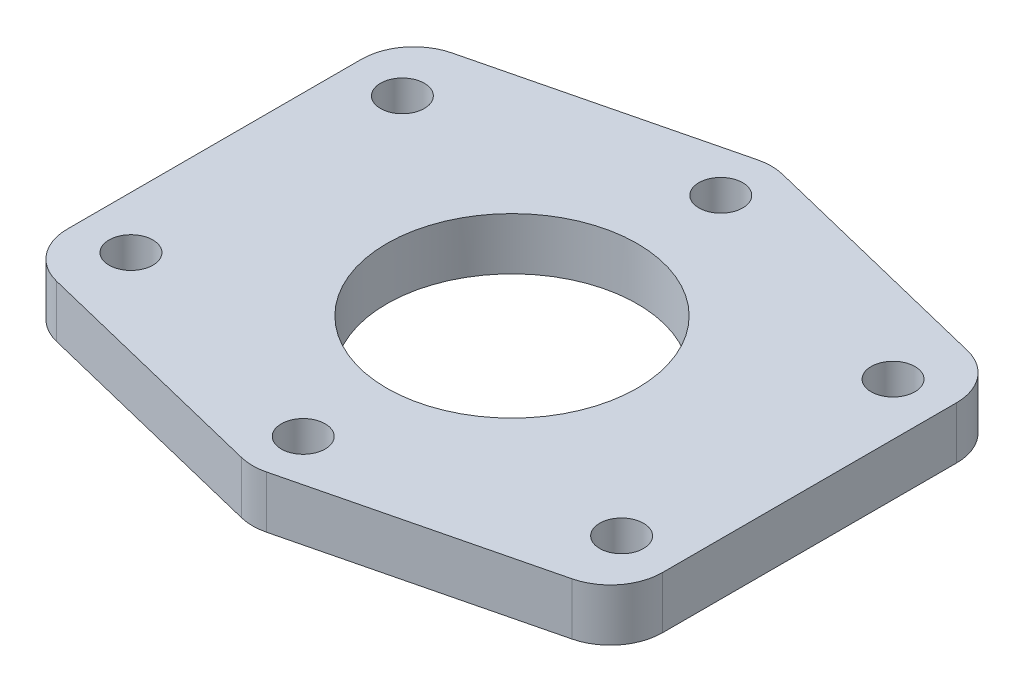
ISO-10303-21;
HEADER;
FILE_DESCRIPTION(('STEP AP214'),'2;1');
FILE_NAME('part.step','',(''),(''),'','','');
FILE_SCHEMA(('AUTOMOTIVE_DESIGN { 1 0 10303 214 1 1 1 1 }'));
ENDSEC;
DATA;
#1=APPLICATION_CONTEXT('core data for automotive mechanical design processes');
#2=APPLICATION_PROTOCOL_DEFINITION('international standard','automotive_design',2000,#1);
#3=PRODUCT_CONTEXT('',#1,'mechanical');
#4=PRODUCT('Part','Part','',(#3));
#5=PRODUCT_RELATED_PRODUCT_CATEGORY('part','',(#4));
#6=PRODUCT_DEFINITION_FORMATION('','',#4);
#7=PRODUCT_DEFINITION_CONTEXT('part definition',#1,'design');
#8=PRODUCT_DEFINITION('design','',#6,#7);
#9=PRODUCT_DEFINITION_SHAPE('','',#8);
#10=(LENGTH_UNIT() NAMED_UNIT(*) SI_UNIT(.MILLI.,.METRE.));
#11=(NAMED_UNIT(*) PLANE_ANGLE_UNIT() SI_UNIT($,.RADIAN.));
#12=(NAMED_UNIT(*) SI_UNIT($,.STERADIAN.) SOLID_ANGLE_UNIT());
#13=UNCERTAINTY_MEASURE_WITH_UNIT(LENGTH_MEASURE(1.E-05),#10,'distance_accuracy_value','');
#14=(GEOMETRIC_REPRESENTATION_CONTEXT(3) GLOBAL_UNCERTAINTY_ASSIGNED_CONTEXT((#13)) GLOBAL_UNIT_ASSIGNED_CONTEXT((#10,
#11,#12)) REPRESENTATION_CONTEXT('',''));
#15=CARTESIAN_POINT('',(0.,0.,0.));
#16=DIRECTION('',(0.,0.,1.));
#17=DIRECTION('',(1.,0.,0.));
#18=AXIS2_PLACEMENT_3D('',#15,#16,#17);
#19=CARTESIAN_POINT('',(0.,5.,0.));
#20=DIRECTION('',(0.,-1.,0.));
#21=DIRECTION('',(0.,0.,-1.));
#22=AXIS2_PLACEMENT_3D('',#19,#20,#21);
#23=PLANE('',#22);
#24=CARTESIAN_POINT('',(0.,5.,-20.));
#25=DIRECTION('',(0.,1.,0.));
#26=DIRECTION('',(0.,0.,1.));
#27=AXIS2_PLACEMENT_3D('',#24,#25,#26);
#28=CIRCLE('',#27,2.1);
#29=CARTESIAN_POINT('',(0.,5.,-17.9));
#30=VERTEX_POINT('',#29);
#31=EDGE_CURVE('E170',#30,#30,#28,.T.);
#32=ORIENTED_EDGE('',*,*,#31,.F.);
#33=EDGE_LOOP('',(#32));
#34=FACE_BOUND('',#33,.T.);
#35=CARTESIAN_POINT('',(0.,5.,20.));
#36=DIRECTION('',(0.,1.,0.));
#37=DIRECTION('',(0.,0.,1.));
#38=AXIS2_PLACEMENT_3D('',#35,#36,#37);
#39=CIRCLE('',#38,2.1);
#40=CARTESIAN_POINT('',(0.,5.,22.1));
#41=VERTEX_POINT('',#40);
#42=EDGE_CURVE('E283',#41,#41,#39,.T.);
#43=ORIENTED_EDGE('',*,*,#42,.F.);
#44=EDGE_LOOP('',(#43));
#45=FACE_BOUND('',#44,.T.);
#46=CARTESIAN_POINT('',(0.,5.,0.));
#47=DIRECTION('',(0.,-1.,0.));
#48=DIRECTION('',(0.,0.,-1.));
#49=AXIS2_PLACEMENT_3D('',#46,#47,#48);
#50=CIRCLE('',#49,12.);
#51=CARTESIAN_POINT('',(0.,5.,-12.));
#52=VERTEX_POINT('',#51);
#53=EDGE_CURVE('E241',#52,#52,#50,.T.);
#54=ORIENTED_EDGE('',*,*,#53,.T.);
#55=EDGE_LOOP('',(#54));
#56=FACE_BOUND('',#55,.T.);
#57=DIRECTION('',(-0.971136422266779,0.,0.238524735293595));
#58=VECTOR('',#57,1.);
#59=CARTESIAN_POINT('',(-28.5,5.,-18.));
#60=LINE('',#59,#58);
#61=CARTESIAN_POINT('',(-1.19262367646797,5.,-24.7070748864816));
#62=VERTEX_POINT('',#61);
#63=CARTESIAN_POINT('',(-24.692623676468,5.,-18.9351450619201));
#64=VERTEX_POINT('',#63);
#65=EDGE_CURVE('E226',#62,#64,#60,.T.);
#66=ORIENTED_EDGE('',*,*,#65,.T.);
#67=CARTESIAN_POINT('',(-23.5,5.,-14.0794629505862));
#68=DIRECTION('',(0.,-1.,0.));
#69=DIRECTION('',(0.,0.,-1.));
#70=AXIS2_PLACEMENT_3D('',#67,#68,#69);
#71=CIRCLE('',#70,5.);
#72=CARTESIAN_POINT('',(-28.5,5.,-14.0794629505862));
#73=VERTEX_POINT('',#72);
#74=EDGE_CURVE('E195',#64,#73,#71,.F.);
#75=ORIENTED_EDGE('',*,*,#74,.T.);
#76=DIRECTION('',(0.,0.,1.));
#77=VECTOR('',#76,1.);
#78=CARTESIAN_POINT('',(-28.5,5.,18.));
#79=LINE('',#78,#77);
#80=CARTESIAN_POINT('',(-28.5,5.,14.0794629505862));
#81=VERTEX_POINT('',#80);
#82=EDGE_CURVE('E149',#73,#81,#79,.T.);
#83=ORIENTED_EDGE('',*,*,#82,.T.);
#84=CARTESIAN_POINT('',(-23.5,5.,14.0794629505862));
#85=DIRECTION('',(0.,-1.,0.));
#86=DIRECTION('',(0.,0.,-1.));
#87=AXIS2_PLACEMENT_3D('',#84,#85,#86);
#88=CIRCLE('',#87,5.);
#89=CARTESIAN_POINT('',(-24.692623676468,5.,18.9351450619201));
#90=VERTEX_POINT('',#89);
#91=EDGE_CURVE('E193',#81,#90,#88,.F.);
#92=ORIENTED_EDGE('',*,*,#91,.T.);
#93=DIRECTION('',(0.971136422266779,0.,0.238524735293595));
#94=VECTOR('',#93,1.);
#95=CARTESIAN_POINT('',(-28.5,5.,18.));
#96=LINE('',#95,#94);
#97=CARTESIAN_POINT('',(-1.19262367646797,5.,24.7070748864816));
#98=VERTEX_POINT('',#97);
#99=EDGE_CURVE('E275',#90,#98,#96,.T.);
#100=ORIENTED_EDGE('',*,*,#99,.T.);
#101=CARTESIAN_POINT('',(0.,5.,19.8513927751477));
#102=DIRECTION('',(0.,-1.,0.));
#103=DIRECTION('',(0.,0.,-1.));
#104=AXIS2_PLACEMENT_3D('',#101,#102,#103);
#105=CIRCLE('',#104,5.);
#106=CARTESIAN_POINT('',(1.19262367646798,5.,24.7070748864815));
#107=VERTEX_POINT('',#106);
#108=EDGE_CURVE('E60',#98,#107,#105,.F.);
#109=ORIENTED_EDGE('',*,*,#108,.T.);
#110=DIRECTION('',(0.971136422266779,0.,-0.238524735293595));
#111=VECTOR('',#110,1.);
#112=CARTESIAN_POINT('',(0.,5.,25.));
#113=LINE('',#112,#111);
#114=CARTESIAN_POINT('',(24.692623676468,5.,18.9351450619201));
#115=VERTEX_POINT('',#114);
#116=EDGE_CURVE('E234',#107,#115,#113,.T.);
#117=ORIENTED_EDGE('',*,*,#116,.T.);
#118=CARTESIAN_POINT('',(23.5,5.,14.0794629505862));
#119=DIRECTION('',(0.,-1.,0.));
#120=DIRECTION('',(0.,0.,-1.));
#121=AXIS2_PLACEMENT_3D('',#118,#119,#120);
#122=CIRCLE('',#121,5.);
#123=CARTESIAN_POINT('',(28.5,5.,14.0794629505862));
#124=VERTEX_POINT('',#123);
#125=EDGE_CURVE('E191',#115,#124,#122,.F.);
#126=ORIENTED_EDGE('',*,*,#125,.T.);
#127=DIRECTION('',(0.,0.,-1.));
#128=VECTOR('',#127,1.);
#129=CARTESIAN_POINT('',(28.5,5.,18.));
#130=LINE('',#129,#128);
#131=CARTESIAN_POINT('',(28.5,5.,-14.0794629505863));
#132=VERTEX_POINT('',#131);
#133=EDGE_CURVE('E156',#124,#132,#130,.T.);
#134=ORIENTED_EDGE('',*,*,#133,.T.);
#135=CARTESIAN_POINT('',(23.5,5.,-14.0794629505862));
#136=DIRECTION('',(0.,-1.,0.));
#137=DIRECTION('',(0.,0.,-1.));
#138=AXIS2_PLACEMENT_3D('',#135,#136,#137);
#139=CIRCLE('',#138,5.);
#140=CARTESIAN_POINT('',(24.692623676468,5.,-18.9351450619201));
#141=VERTEX_POINT('',#140);
#142=EDGE_CURVE('E189',#132,#141,#139,.F.);
#143=ORIENTED_EDGE('',*,*,#142,.T.);
#144=DIRECTION('',(-0.971136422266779,0.,-0.238524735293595));
#145=VECTOR('',#144,1.);
#146=CARTESIAN_POINT('',(0.,5.,-25.));
#147=LINE('',#146,#145);
#148=CARTESIAN_POINT('',(1.19262367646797,5.,-24.7070748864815));
#149=VERTEX_POINT('',#148);
#150=EDGE_CURVE('E216',#141,#149,#147,.T.);
#151=ORIENTED_EDGE('',*,*,#150,.T.);
#152=CARTESIAN_POINT('',(0.,5.,-19.8513927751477));
#153=DIRECTION('',(0.,-1.,0.));
#154=DIRECTION('',(0.,0.,-1.));
#155=AXIS2_PLACEMENT_3D('',#152,#153,#154);
#156=CIRCLE('',#155,5.);
#157=EDGE_CURVE('E187',#149,#62,#156,.F.);
#158=ORIENTED_EDGE('',*,*,#157,.T.);
#159=EDGE_LOOP('',(#66,#75,#83,#92,#100,#109,#117,#126,#134,#143,#151,#158));
#160=FACE_BOUND('',#159,.T.);
#161=CARTESIAN_POINT('',(-23.5,5.,-13.));
#162=DIRECTION('',(0.,1.,0.));
#163=DIRECTION('',(0.,0.,1.));
#164=AXIS2_PLACEMENT_3D('',#161,#162,#163);
#165=CIRCLE('',#164,2.1);
#166=CARTESIAN_POINT('',(-23.5,5.,-10.9));
#167=VERTEX_POINT('',#166);
#168=EDGE_CURVE('E162',#167,#167,#165,.T.);
#169=ORIENTED_EDGE('',*,*,#168,.F.);
#170=EDGE_LOOP('',(#169));
#171=FACE_BOUND('',#170,.T.);
#172=CARTESIAN_POINT('',(-23.5,5.,13.));
#173=DIRECTION('',(0.,1.,0.));
#174=DIRECTION('',(0.,0.,1.));
#175=AXIS2_PLACEMENT_3D('',#172,#173,#174);
#176=CIRCLE('',#175,2.1);
#177=CARTESIAN_POINT('',(-23.5,5.,15.1));
#178=VERTEX_POINT('',#177);
#179=EDGE_CURVE('E257',#178,#178,#176,.T.);
#180=ORIENTED_EDGE('',*,*,#179,.F.);
#181=EDGE_LOOP('',(#180));
#182=FACE_BOUND('',#181,.T.);
#183=CARTESIAN_POINT('',(23.5,5.,-13.));
#184=DIRECTION('',(0.,1.,0.));
#185=DIRECTION('',(0.,0.,1.));
#186=AXIS2_PLACEMENT_3D('',#183,#184,#185);
#187=CIRCLE('',#186,2.1);
#188=CARTESIAN_POINT('',(23.5,5.,-10.9));
#189=VERTEX_POINT('',#188);
#190=EDGE_CURVE('E251',#189,#189,#187,.T.);
#191=ORIENTED_EDGE('',*,*,#190,.F.);
#192=EDGE_LOOP('',(#191));
#193=FACE_BOUND('',#192,.T.);
#194=CARTESIAN_POINT('',(23.5,5.,13.));
#195=DIRECTION('',(0.,1.,0.));
#196=DIRECTION('',(0.,0.,1.));
#197=AXIS2_PLACEMENT_3D('',#194,#195,#196);
#198=CIRCLE('',#197,2.1);
#199=CARTESIAN_POINT('',(23.5,5.,15.1));
#200=VERTEX_POINT('',#199);
#201=EDGE_CURVE('E245',#200,#200,#198,.T.);
#202=ORIENTED_EDGE('',*,*,#201,.F.);
#203=EDGE_LOOP('',(#202));
#204=FACE_BOUND('',#203,.T.);
#205=ADVANCED_FACE('F38',(#34,#45,#56,#160,#171,#182,#193,#204),#23,.F.);
#206=CARTESIAN_POINT('',(0.,0.,0.));
#207=DIRECTION('',(0.,-1.,0.));
#208=DIRECTION('',(0.,0.,-1.));
#209=AXIS2_PLACEMENT_3D('',#206,#207,#208);
#210=PLANE('',#209);
#211=CARTESIAN_POINT('',(0.,0.,-20.));
#212=DIRECTION('',(0.,-1.,0.));
#213=DIRECTION('',(0.,0.,-1.));
#214=AXIS2_PLACEMENT_3D('',#211,#212,#213);
#215=CIRCLE('',#214,2.1);
#216=CARTESIAN_POINT('',(0.,0.,-22.1));
#217=VERTEX_POINT('',#216);
#218=EDGE_CURVE('E169',#217,#217,#215,.F.);
#219=ORIENTED_EDGE('',*,*,#218,.T.);
#220=EDGE_LOOP('',(#219));
#221=FACE_BOUND('',#220,.T.);
#222=CARTESIAN_POINT('',(0.,0.,20.));
#223=DIRECTION('',(0.,-1.,0.));
#224=DIRECTION('',(0.,0.,-1.));
#225=AXIS2_PLACEMENT_3D('',#222,#223,#224);
#226=CIRCLE('',#225,2.1);
#227=CARTESIAN_POINT('',(0.,0.,17.9));
#228=VERTEX_POINT('',#227);
#229=EDGE_CURVE('E166',#228,#228,#226,.F.);
#230=ORIENTED_EDGE('',*,*,#229,.T.);
#231=EDGE_LOOP('',(#230));
#232=FACE_BOUND('',#231,.T.);
#233=CARTESIAN_POINT('',(0.,0.,0.));
#234=DIRECTION('',(0.,1.,0.));
#235=DIRECTION('',(0.,0.,1.));
#236=AXIS2_PLACEMENT_3D('',#233,#234,#235);
#237=CIRCLE('',#236,12.);
#238=CARTESIAN_POINT('',(0.,0.,12.));
#239=VERTEX_POINT('',#238);
#240=EDGE_CURVE('E238',#239,#239,#237,.T.);
#241=ORIENTED_EDGE('',*,*,#240,.T.);
#242=EDGE_LOOP('',(#241));
#243=FACE_BOUND('',#242,.T.);
#244=CARTESIAN_POINT('',(23.5,0.,-13.));
#245=DIRECTION('',(0.,1.,0.));
#246=DIRECTION('',(0.,0.,1.));
#247=AXIS2_PLACEMENT_3D('',#244,#245,#246);
#248=CIRCLE('',#247,2.1);
#249=CARTESIAN_POINT('',(23.5,0.,-10.9));
#250=VERTEX_POINT('',#249);
#251=EDGE_CURVE('E248',#250,#250,#248,.T.);
#252=ORIENTED_EDGE('',*,*,#251,.T.);
#253=EDGE_LOOP('',(#252));
#254=FACE_BOUND('',#253,.T.);
#255=CARTESIAN_POINT('',(-23.5,0.,-13.));
#256=DIRECTION('',(0.,1.,0.));
#257=DIRECTION('',(0.,0.,1.));
#258=AXIS2_PLACEMENT_3D('',#255,#256,#257);
#259=CIRCLE('',#258,2.1);
#260=CARTESIAN_POINT('',(-23.5,0.,-10.9));
#261=VERTEX_POINT('',#260);
#262=EDGE_CURVE('E260',#261,#261,#259,.T.);
#263=ORIENTED_EDGE('',*,*,#262,.T.);
#264=EDGE_LOOP('',(#263));
#265=FACE_BOUND('',#264,.T.);
#266=DIRECTION('',(0.,0.,1.));
#267=VECTOR('',#266,1.);
#268=CARTESIAN_POINT('',(-28.5,0.,18.));
#269=LINE('',#268,#267);
#270=CARTESIAN_POINT('',(-28.5,0.,-14.0794629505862));
#271=VERTEX_POINT('',#270);
#272=CARTESIAN_POINT('',(-28.5,0.,14.0794629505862));
#273=VERTEX_POINT('',#272);
#274=EDGE_CURVE('E146',#271,#273,#269,.T.);
#275=ORIENTED_EDGE('',*,*,#274,.F.);
#276=CARTESIAN_POINT('',(-23.5,0.,-14.0794629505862));
#277=DIRECTION('',(0.,-1.,0.));
#278=DIRECTION('',(0.,0.,-1.));
#279=AXIS2_PLACEMENT_3D('',#276,#277,#278);
#280=CIRCLE('',#279,5.);
#281=CARTESIAN_POINT('',(-24.692623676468,0.,-18.9351450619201));
#282=VERTEX_POINT('',#281);
#283=EDGE_CURVE('E129',#271,#282,#280,.T.);
#284=ORIENTED_EDGE('',*,*,#283,.T.);
#285=DIRECTION('',(-0.971136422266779,0.,0.238524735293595));
#286=VECTOR('',#285,1.);
#287=CARTESIAN_POINT('',(-28.5,0.,-18.));
#288=LINE('',#287,#286);
#289=CARTESIAN_POINT('',(-1.19262367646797,0.,-24.7070748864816));
#290=VERTEX_POINT('',#289);
#291=EDGE_CURVE('E227',#290,#282,#288,.T.);
#292=ORIENTED_EDGE('',*,*,#291,.F.);
#293=CARTESIAN_POINT('',(0.,0.,-19.8513927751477));
#294=DIRECTION('',(0.,-1.,0.));
#295=DIRECTION('',(0.,0.,-1.));
#296=AXIS2_PLACEMENT_3D('',#293,#294,#295);
#297=CIRCLE('',#296,5.);
#298=CARTESIAN_POINT('',(1.19262367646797,0.,-24.7070748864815));
#299=VERTEX_POINT('',#298);
#300=EDGE_CURVE('E176',#290,#299,#297,.T.);
#301=ORIENTED_EDGE('',*,*,#300,.T.);
#302=DIRECTION('',(-0.971136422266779,0.,-0.238524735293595));
#303=VECTOR('',#302,1.);
#304=CARTESIAN_POINT('',(0.,0.,-25.));
#305=LINE('',#304,#303);
#306=CARTESIAN_POINT('',(24.692623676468,0.,-18.9351450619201));
#307=VERTEX_POINT('',#306);
#308=EDGE_CURVE('E219',#307,#299,#305,.T.);
#309=ORIENTED_EDGE('',*,*,#308,.F.);
#310=CARTESIAN_POINT('',(23.5,0.,-14.0794629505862));
#311=DIRECTION('',(0.,-1.,0.));
#312=DIRECTION('',(0.,0.,-1.));
#313=AXIS2_PLACEMENT_3D('',#310,#311,#312);
#314=CIRCLE('',#313,5.);
#315=CARTESIAN_POINT('',(28.5,0.,-14.0794629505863));
#316=VERTEX_POINT('',#315);
#317=EDGE_CURVE('E178',#307,#316,#314,.T.);
#318=ORIENTED_EDGE('',*,*,#317,.T.);
#319=DIRECTION('',(0.,0.,-1.));
#320=VECTOR('',#319,1.);
#321=CARTESIAN_POINT('',(28.5,0.,18.));
#322=LINE('',#321,#320);
#323=CARTESIAN_POINT('',(28.5,0.,14.0794629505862));
#324=VERTEX_POINT('',#323);
#325=EDGE_CURVE('E157',#324,#316,#322,.T.);
#326=ORIENTED_EDGE('',*,*,#325,.F.);
#327=CARTESIAN_POINT('',(23.5,0.,14.0794629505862));
#328=DIRECTION('',(0.,-1.,0.));
#329=DIRECTION('',(0.,0.,-1.));
#330=AXIS2_PLACEMENT_3D('',#327,#328,#329);
#331=CIRCLE('',#330,5.);
#332=CARTESIAN_POINT('',(24.692623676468,0.,18.9351450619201));
#333=VERTEX_POINT('',#332);
#334=EDGE_CURVE('E180',#324,#333,#331,.T.);
#335=ORIENTED_EDGE('',*,*,#334,.T.);
#336=DIRECTION('',(0.971136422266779,0.,-0.238524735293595));
#337=VECTOR('',#336,1.);
#338=CARTESIAN_POINT('',(0.,0.,25.));
#339=LINE('',#338,#337);
#340=CARTESIAN_POINT('',(1.19262367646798,0.,24.7070748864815));
#341=VERTEX_POINT('',#340);
#342=EDGE_CURVE('E277',#341,#333,#339,.T.);
#343=ORIENTED_EDGE('',*,*,#342,.F.);
#344=CARTESIAN_POINT('',(0.,0.,19.8513927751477));
#345=DIRECTION('',(0.,-1.,0.));
#346=DIRECTION('',(0.,0.,-1.));
#347=AXIS2_PLACEMENT_3D('',#344,#345,#346);
#348=CIRCLE('',#347,5.);
#349=CARTESIAN_POINT('',(-1.19262367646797,0.,24.7070748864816));
#350=VERTEX_POINT('',#349);
#351=EDGE_CURVE('E150',#341,#350,#348,.T.);
#352=ORIENTED_EDGE('',*,*,#351,.T.);
#353=DIRECTION('',(0.971136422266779,0.,0.238524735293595));
#354=VECTOR('',#353,1.);
#355=CARTESIAN_POINT('',(-28.5,0.,18.));
#356=LINE('',#355,#354);
#357=CARTESIAN_POINT('',(-24.692623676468,0.,18.9351450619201));
#358=VERTEX_POINT('',#357);
#359=EDGE_CURVE('E173',#358,#350,#356,.T.);
#360=ORIENTED_EDGE('',*,*,#359,.F.);
#361=CARTESIAN_POINT('',(-23.5,0.,14.0794629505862));
#362=DIRECTION('',(0.,-1.,0.));
#363=DIRECTION('',(0.,0.,-1.));
#364=AXIS2_PLACEMENT_3D('',#361,#362,#363);
#365=CIRCLE('',#364,5.);
#366=EDGE_CURVE('E140',#358,#273,#365,.T.);
#367=ORIENTED_EDGE('',*,*,#366,.T.);
#368=EDGE_LOOP('',(#275,#284,#292,#301,#309,#318,#326,#335,#343,#352,#360,#367));
#369=FACE_BOUND('',#368,.T.);
#370=CARTESIAN_POINT('',(-23.5,0.,13.));
#371=DIRECTION('',(0.,1.,0.));
#372=DIRECTION('',(0.,0.,1.));
#373=AXIS2_PLACEMENT_3D('',#370,#371,#372);
#374=CIRCLE('',#373,2.1);
#375=CARTESIAN_POINT('',(-23.5,0.,15.1));
#376=VERTEX_POINT('',#375);
#377=EDGE_CURVE('E254',#376,#376,#374,.T.);
#378=ORIENTED_EDGE('',*,*,#377,.T.);
#379=EDGE_LOOP('',(#378));
#380=FACE_BOUND('',#379,.T.);
#381=CARTESIAN_POINT('',(23.5,0.,13.));
#382=DIRECTION('',(0.,1.,0.));
#383=DIRECTION('',(0.,0.,1.));
#384=AXIS2_PLACEMENT_3D('',#381,#382,#383);
#385=CIRCLE('',#384,2.1);
#386=CARTESIAN_POINT('',(23.5,0.,15.1));
#387=VERTEX_POINT('',#386);
#388=EDGE_CURVE('E244',#387,#387,#385,.T.);
#389=ORIENTED_EDGE('',*,*,#388,.T.);
#390=EDGE_LOOP('',(#389));
#391=FACE_BOUND('',#390,.T.);
#392=ADVANCED_FACE('F153',(#221,#232,#243,#254,#265,#369,#380,#391),#210,.T.);
#393=CARTESIAN_POINT('',(28.5,5.,18.));
#394=DIRECTION('',(-1.,0.,0.));
#395=DIRECTION('',(0.,0.,1.));
#396=AXIS2_PLACEMENT_3D('',#393,#394,#395);
#397=PLANE('',#396);
#398=ORIENTED_EDGE('',*,*,#133,.F.);
#399=DIRECTION('',(0.,-1.,0.));
#400=VECTOR('',#399,1.);
#401=CARTESIAN_POINT('',(28.5,5.,14.0794629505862));
#402=LINE('',#401,#400);
#403=EDGE_CURVE('E204',#124,#324,#402,.T.);
#404=ORIENTED_EDGE('',*,*,#403,.T.);
#405=ORIENTED_EDGE('',*,*,#325,.T.);
#406=DIRECTION('',(0.,-1.,0.));
#407=VECTOR('',#406,1.);
#408=CARTESIAN_POINT('',(28.5,5.,-14.0794629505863));
#409=LINE('',#408,#407);
#410=EDGE_CURVE('E202',#316,#132,#409,.F.);
#411=ORIENTED_EDGE('',*,*,#410,.T.);
#412=EDGE_LOOP('',(#398,#404,#405,#411));
#413=FACE_BOUND('',#412,.T.);
#414=ADVANCED_FACE('F328',(#413),#397,.F.);
#415=CARTESIAN_POINT('',(-28.5,5.,18.));
#416=DIRECTION('',(1.,0.,0.));
#417=DIRECTION('',(0.,0.,-1.));
#418=AXIS2_PLACEMENT_3D('',#415,#416,#417);
#419=PLANE('',#418);
#420=ORIENTED_EDGE('',*,*,#82,.F.);
#421=DIRECTION('',(0.,-1.,0.));
#422=VECTOR('',#421,1.);
#423=CARTESIAN_POINT('',(-28.5,5.,-14.0794629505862));
#424=LINE('',#423,#422);
#425=EDGE_CURVE('E133',#73,#271,#424,.T.);
#426=ORIENTED_EDGE('',*,*,#425,.T.);
#427=ORIENTED_EDGE('',*,*,#274,.T.);
#428=DIRECTION('',(0.,-1.,0.));
#429=VECTOR('',#428,1.);
#430=CARTESIAN_POINT('',(-28.5,5.,14.0794629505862));
#431=LINE('',#430,#429);
#432=EDGE_CURVE('E151',#273,#81,#431,.F.);
#433=ORIENTED_EDGE('',*,*,#432,.T.);
#434=EDGE_LOOP('',(#420,#426,#427,#433));
#435=FACE_BOUND('',#434,.T.);
#436=ADVANCED_FACE('F145',(#435),#419,.F.);
#437=CARTESIAN_POINT('',(-23.5,5.,-13.));
#438=DIRECTION('',(0.,-1.,0.));
#439=DIRECTION('',(0.,0.,-1.));
#440=AXIS2_PLACEMENT_3D('',#437,#438,#439);
#441=CYLINDRICAL_SURFACE('',#440,2.1);
#442=ORIENTED_EDGE('',*,*,#168,.T.);
#443=EDGE_LOOP('',(#442));
#444=FACE_BOUND('',#443,.T.);
#445=ORIENTED_EDGE('',*,*,#262,.F.);
#446=EDGE_LOOP('',(#445));
#447=FACE_BOUND('',#446,.T.);
#448=ADVANCED_FACE('F321',(#444,#447),#441,.F.);
#449=CARTESIAN_POINT('',(-23.5,5.,13.));
#450=DIRECTION('',(0.,-1.,0.));
#451=DIRECTION('',(0.,0.,-1.));
#452=AXIS2_PLACEMENT_3D('',#449,#450,#451);
#453=CYLINDRICAL_SURFACE('',#452,2.1);
#454=ORIENTED_EDGE('',*,*,#179,.T.);
#455=EDGE_LOOP('',(#454));
#456=FACE_BOUND('',#455,.T.);
#457=ORIENTED_EDGE('',*,*,#377,.F.);
#458=EDGE_LOOP('',(#457));
#459=FACE_BOUND('',#458,.T.);
#460=ADVANCED_FACE('F317',(#456,#459),#453,.F.);
#461=CARTESIAN_POINT('',(23.5,5.,-13.));
#462=DIRECTION('',(0.,-1.,0.));
#463=DIRECTION('',(0.,0.,-1.));
#464=AXIS2_PLACEMENT_3D('',#461,#462,#463);
#465=CYLINDRICAL_SURFACE('',#464,2.1);
#466=ORIENTED_EDGE('',*,*,#190,.T.);
#467=EDGE_LOOP('',(#466));
#468=FACE_BOUND('',#467,.T.);
#469=ORIENTED_EDGE('',*,*,#251,.F.);
#470=EDGE_LOOP('',(#469));
#471=FACE_BOUND('',#470,.T.);
#472=ADVANCED_FACE('F309',(#468,#471),#465,.F.);
#473=CARTESIAN_POINT('',(23.5,5.,13.));
#474=DIRECTION('',(0.,-1.,0.));
#475=DIRECTION('',(0.,0.,-1.));
#476=AXIS2_PLACEMENT_3D('',#473,#474,#475);
#477=CYLINDRICAL_SURFACE('',#476,2.1);
#478=ORIENTED_EDGE('',*,*,#201,.T.);
#479=EDGE_LOOP('',(#478));
#480=FACE_BOUND('',#479,.T.);
#481=ORIENTED_EDGE('',*,*,#388,.F.);
#482=EDGE_LOOP('',(#481));
#483=FACE_BOUND('',#482,.T.);
#484=ADVANCED_FACE('F300',(#480,#483),#477,.F.);
#485=CARTESIAN_POINT('',(0.,0.,0.));
#486=DIRECTION('',(0.,1.,0.));
#487=DIRECTION('',(0.,0.,1.));
#488=AXIS2_PLACEMENT_3D('',#485,#486,#487);
#489=CYLINDRICAL_SURFACE('',#488,12.);
#490=ORIENTED_EDGE('',*,*,#240,.F.);
#491=EDGE_LOOP('',(#490));
#492=FACE_BOUND('',#491,.T.);
#493=ORIENTED_EDGE('',*,*,#53,.F.);
#494=EDGE_LOOP('',(#493));
#495=FACE_BOUND('',#494,.T.);
#496=ADVANCED_FACE('F298',(#492,#495),#489,.F.);
#497=CARTESIAN_POINT('',(0.,5.,-25.));
#498=DIRECTION('',(-0.238524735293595,0.,0.971136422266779));
#499=DIRECTION('',(0.971136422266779,0.,0.238524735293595));
#500=AXIS2_PLACEMENT_3D('',#497,#498,#499);
#501=PLANE('',#500);
#502=ORIENTED_EDGE('',*,*,#150,.F.);
#503=DIRECTION('',(0.,-1.,0.));
#504=VECTOR('',#503,1.);
#505=CARTESIAN_POINT('',(24.692623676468,5.,-18.9351450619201));
#506=LINE('',#505,#504);
#507=EDGE_CURVE('E11',#141,#307,#506,.T.);
#508=ORIENTED_EDGE('',*,*,#507,.T.);
#509=ORIENTED_EDGE('',*,*,#308,.T.);
#510=DIRECTION('',(0.,-1.,0.));
#511=VECTOR('',#510,1.);
#512=CARTESIAN_POINT('',(1.19262367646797,5.,-24.7070748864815));
#513=LINE('',#512,#511);
#514=EDGE_CURVE('E46',#299,#149,#513,.F.);
#515=ORIENTED_EDGE('',*,*,#514,.T.);
#516=EDGE_LOOP('',(#502,#508,#509,#515));
#517=FACE_BOUND('',#516,.T.);
#518=ADVANCED_FACE('F215',(#517),#501,.F.);
#519=CARTESIAN_POINT('',(-28.5,5.,-18.));
#520=DIRECTION('',(0.238524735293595,0.,0.971136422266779));
#521=DIRECTION('',(0.971136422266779,0.,-0.238524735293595));
#522=AXIS2_PLACEMENT_3D('',#519,#520,#521);
#523=PLANE('',#522);
#524=ORIENTED_EDGE('',*,*,#291,.T.);
#525=DIRECTION('',(0.,-1.,0.));
#526=VECTOR('',#525,1.);
#527=CARTESIAN_POINT('',(-24.692623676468,5.,-18.9351450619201));
#528=LINE('',#527,#526);
#529=EDGE_CURVE('E134',#282,#64,#528,.F.);
#530=ORIENTED_EDGE('',*,*,#529,.T.);
#531=ORIENTED_EDGE('',*,*,#65,.F.);
#532=DIRECTION('',(0.,-1.,0.));
#533=VECTOR('',#532,1.);
#534=CARTESIAN_POINT('',(-1.19262367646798,5.,-24.7070748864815));
#535=LINE('',#534,#533);
#536=EDGE_CURVE('E139',#62,#290,#535,.T.);
#537=ORIENTED_EDGE('',*,*,#536,.T.);
#538=EDGE_LOOP('',(#524,#530,#531,#537));
#539=FACE_BOUND('',#538,.T.);
#540=ADVANCED_FACE('F232',(#539),#523,.F.);
#541=CARTESIAN_POINT('',(-28.5,5.,18.));
#542=DIRECTION('',(0.238524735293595,0.,-0.971136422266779));
#543=DIRECTION('',(-0.971136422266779,0.,-0.238524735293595));
#544=AXIS2_PLACEMENT_3D('',#541,#542,#543);
#545=PLANE('',#544);
#546=ORIENTED_EDGE('',*,*,#99,.F.);
#547=DIRECTION('',(0.,-1.,0.));
#548=VECTOR('',#547,1.);
#549=CARTESIAN_POINT('',(-24.692623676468,5.,18.9351450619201));
#550=LINE('',#549,#548);
#551=EDGE_CURVE('E199',#90,#358,#550,.T.);
#552=ORIENTED_EDGE('',*,*,#551,.T.);
#553=ORIENTED_EDGE('',*,*,#359,.T.);
#554=DIRECTION('',(0.,-1.,0.));
#555=VECTOR('',#554,1.);
#556=CARTESIAN_POINT('',(-1.19262367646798,5.,24.7070748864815));
#557=LINE('',#556,#555);
#558=EDGE_CURVE('E197',#350,#98,#557,.F.);
#559=ORIENTED_EDGE('',*,*,#558,.T.);
#560=EDGE_LOOP('',(#546,#552,#553,#559));
#561=FACE_BOUND('',#560,.T.);
#562=ADVANCED_FACE('F273',(#561),#545,.F.);
#563=CARTESIAN_POINT('',(0.,5.,25.));
#564=DIRECTION('',(-0.238524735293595,0.,-0.971136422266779));
#565=DIRECTION('',(-0.971136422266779,0.,0.238524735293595));
#566=AXIS2_PLACEMENT_3D('',#563,#564,#565);
#567=PLANE('',#566);
#568=ORIENTED_EDGE('',*,*,#342,.T.);
#569=DIRECTION('',(0.,-1.,0.));
#570=VECTOR('',#569,1.);
#571=CARTESIAN_POINT('',(24.692623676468,5.,18.9351450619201));
#572=LINE('',#571,#570);
#573=EDGE_CURVE('E53',#333,#115,#572,.F.);
#574=ORIENTED_EDGE('',*,*,#573,.T.);
#575=ORIENTED_EDGE('',*,*,#116,.F.);
#576=DIRECTION('',(0.,-1.,0.));
#577=VECTOR('',#576,1.);
#578=CARTESIAN_POINT('',(1.19262367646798,5.,24.7070748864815));
#579=LINE('',#578,#577);
#580=EDGE_CURVE('E207',#107,#341,#579,.T.);
#581=ORIENTED_EDGE('',*,*,#580,.T.);
#582=EDGE_LOOP('',(#568,#574,#575,#581));
#583=FACE_BOUND('',#582,.T.);
#584=ADVANCED_FACE('F354',(#583),#567,.F.);
#585=CARTESIAN_POINT('',(0.,5.,20.));
#586=DIRECTION('',(0.,-1.,0.));
#587=DIRECTION('',(0.,0.,-1.));
#588=AXIS2_PLACEMENT_3D('',#585,#586,#587);
#589=CYLINDRICAL_SURFACE('',#588,2.1);
#590=ORIENTED_EDGE('',*,*,#229,.F.);
#591=EDGE_LOOP('',(#590));
#592=FACE_BOUND('',#591,.T.);
#593=ORIENTED_EDGE('',*,*,#42,.T.);
#594=EDGE_LOOP('',(#593));
#595=FACE_BOUND('',#594,.T.);
#596=ADVANCED_FACE('F361',(#592,#595),#589,.F.);
#597=CARTESIAN_POINT('',(0.,5.,-20.));
#598=DIRECTION('',(0.,-1.,0.));
#599=DIRECTION('',(0.,0.,-1.));
#600=AXIS2_PLACEMENT_3D('',#597,#598,#599);
#601=CYLINDRICAL_SURFACE('',#600,2.1);
#602=ORIENTED_EDGE('',*,*,#218,.F.);
#603=EDGE_LOOP('',(#602));
#604=FACE_BOUND('',#603,.T.);
#605=ORIENTED_EDGE('',*,*,#31,.T.);
#606=EDGE_LOOP('',(#605));
#607=FACE_BOUND('',#606,.T.);
#608=ADVANCED_FACE('F289',(#604,#607),#601,.F.);
#609=CARTESIAN_POINT('',(-23.5,5.,-14.0794629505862));
#610=DIRECTION('',(0.,-1.,0.));
#611=DIRECTION('',(0.,0.,-1.));
#612=AXIS2_PLACEMENT_3D('',#609,#610,#611);
#613=CYLINDRICAL_SURFACE('',#612,5.);
#614=ORIENTED_EDGE('',*,*,#74,.F.);
#615=ORIENTED_EDGE('',*,*,#529,.F.);
#616=ORIENTED_EDGE('',*,*,#283,.F.);
#617=ORIENTED_EDGE('',*,*,#425,.F.);
#618=EDGE_LOOP('',(#614,#615,#616,#617));
#619=FACE_BOUND('',#618,.T.);
#620=ADVANCED_FACE('F132',(#619),#613,.T.);
#621=CARTESIAN_POINT('',(-23.5,5.,14.0794629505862));
#622=DIRECTION('',(0.,-1.,0.));
#623=DIRECTION('',(0.,0.,-1.));
#624=AXIS2_PLACEMENT_3D('',#621,#622,#623);
#625=CYLINDRICAL_SURFACE('',#624,5.);
#626=ORIENTED_EDGE('',*,*,#91,.F.);
#627=ORIENTED_EDGE('',*,*,#432,.F.);
#628=ORIENTED_EDGE('',*,*,#366,.F.);
#629=ORIENTED_EDGE('',*,*,#551,.F.);
#630=EDGE_LOOP('',(#626,#627,#628,#629));
#631=FACE_BOUND('',#630,.T.);
#632=ADVANCED_FACE('F270',(#631),#625,.T.);
#633=CARTESIAN_POINT('',(23.5,5.,14.0794629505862));
#634=DIRECTION('',(0.,-1.,0.));
#635=DIRECTION('',(0.,0.,-1.));
#636=AXIS2_PLACEMENT_3D('',#633,#634,#635);
#637=CYLINDRICAL_SURFACE('',#636,5.);
#638=ORIENTED_EDGE('',*,*,#125,.F.);
#639=ORIENTED_EDGE('',*,*,#573,.F.);
#640=ORIENTED_EDGE('',*,*,#334,.F.);
#641=ORIENTED_EDGE('',*,*,#403,.F.);
#642=EDGE_LOOP('',(#638,#639,#640,#641));
#643=FACE_BOUND('',#642,.T.);
#644=ADVANCED_FACE('F339',(#643),#637,.T.);
#645=CARTESIAN_POINT('',(23.5,5.,-14.0794629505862));
#646=DIRECTION('',(0.,-1.,0.));
#647=DIRECTION('',(0.,0.,-1.));
#648=AXIS2_PLACEMENT_3D('',#645,#646,#647);
#649=CYLINDRICAL_SURFACE('',#648,5.);
#650=ORIENTED_EDGE('',*,*,#142,.F.);
#651=ORIENTED_EDGE('',*,*,#410,.F.);
#652=ORIENTED_EDGE('',*,*,#317,.F.);
#653=ORIENTED_EDGE('',*,*,#507,.F.);
#654=EDGE_LOOP('',(#650,#651,#652,#653));
#655=FACE_BOUND('',#654,.T.);
#656=ADVANCED_FACE('F342',(#655),#649,.T.);
#657=CARTESIAN_POINT('',(0.,5.,-19.8513927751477));
#658=DIRECTION('',(0.,-1.,0.));
#659=DIRECTION('',(0.,0.,-1.));
#660=AXIS2_PLACEMENT_3D('',#657,#658,#659);
#661=CYLINDRICAL_SURFACE('',#660,5.);
#662=ORIENTED_EDGE('',*,*,#157,.F.);
#663=ORIENTED_EDGE('',*,*,#514,.F.);
#664=ORIENTED_EDGE('',*,*,#300,.F.);
#665=ORIENTED_EDGE('',*,*,#536,.F.);
#666=EDGE_LOOP('',(#662,#663,#664,#665));
#667=FACE_BOUND('',#666,.T.);
#668=ADVANCED_FACE('F230',(#667),#661,.T.);
#669=CARTESIAN_POINT('',(0.,5.,19.8513927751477));
#670=DIRECTION('',(0.,-1.,0.));
#671=DIRECTION('',(0.,0.,-1.));
#672=AXIS2_PLACEMENT_3D('',#669,#670,#671);
#673=CYLINDRICAL_SURFACE('',#672,5.);
#674=ORIENTED_EDGE('',*,*,#108,.F.);
#675=ORIENTED_EDGE('',*,*,#558,.F.);
#676=ORIENTED_EDGE('',*,*,#351,.F.);
#677=ORIENTED_EDGE('',*,*,#580,.F.);
#678=EDGE_LOOP('',(#674,#675,#676,#677));
#679=FACE_BOUND('',#678,.T.);
#680=ADVANCED_FACE('F40',(#679),#673,.T.);
#681=CLOSED_SHELL('',(#205,#392,#414,#436,#448,#460,#472,#484,#496,#518,#540,#562,#584,#596,
#608,#620,#632,#644,#656,#668,#680));
#682=MANIFOLD_SOLID_BREP('B2',#681);
#683=ADVANCED_BREP_SHAPE_REPRESENTATION('',(#18,#682),#14);
#684=SHAPE_DEFINITION_REPRESENTATION(#9,#683);
ENDSEC;
END-ISO-10303-21;
